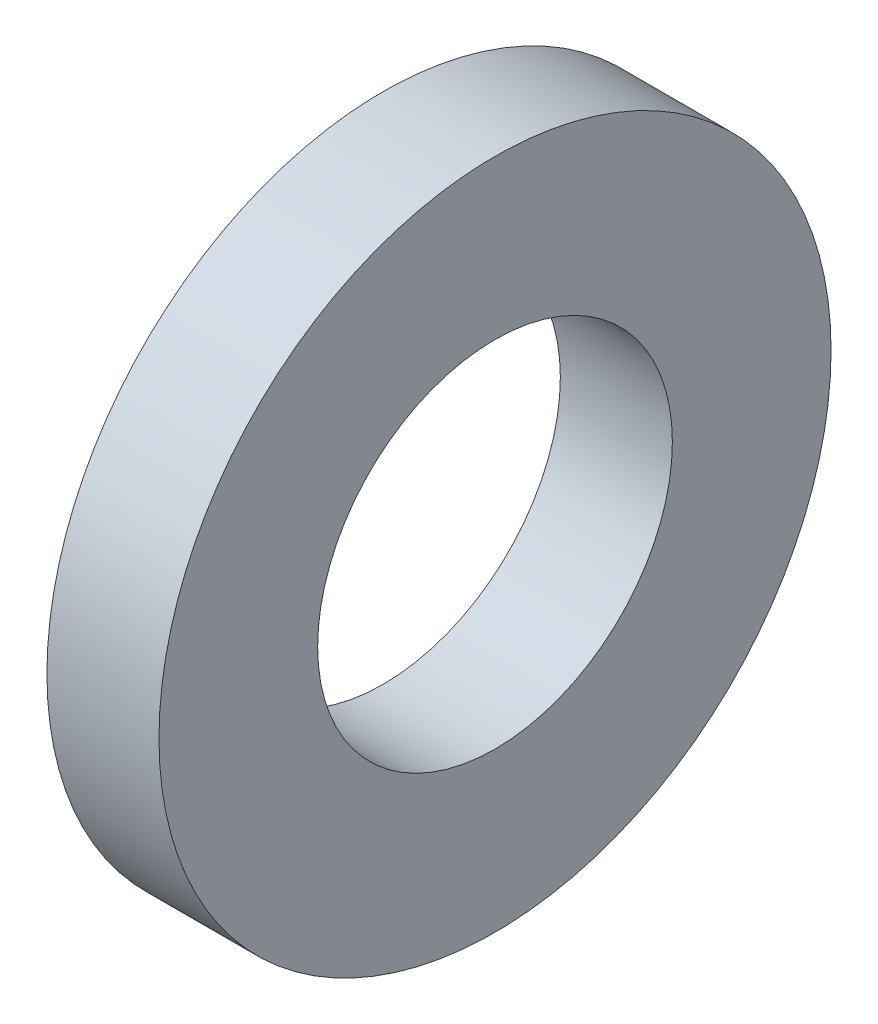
from build123d import *

# Parameters (mm, degrees)
SKETCH1_W                         = 76.2
SKETCH1_H                         = 107.95
SKETCH2_R                         = 12.7
F_25_4_MM_HOLE_CUT_EXTRUDE1_DEPTH = 30
F_25_4MM_HOLES_CIRPATTERN1_COUNT  = 8


with BuildPart() as part:
    # Sketch1 → Revolve1 (revolve)
    with BuildSketch(Plane.XY, mode=Mode.PRIVATE) as revolve1_sk:
        with Locations((38.1, 174.625)):
            Rectangle(SKETCH1_W, SKETCH1_H)
    revolve(revolve1_sk.sketch.rotate(Axis((0, 0, 0), (1, 0, 0)), 90), axis=Axis((0, 0, 0), (1, 0, 0)))

    # Sketch2 → 25.4 mm hole Cut-Extrude1 (cut)
    with BuildSketch(Plane.ZY):
        with Locations((60.750994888, 146.665875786)):
            Circle(SKETCH2_R)
    f_25_4_mm_hole_cut_extrude1 = extrude(amount=-F_25_4_MM_HOLE_CUT_EXTRUDE1_DEPTH, mode=Mode.SUBTRACT)

    # 25.4mm holes CirPattern1: 25.4 mm hole Cut-Extrude1 ×8 about axis
    f_25_4mm_holes_cirpattern1_axis = Axis((0, 0, 0), (1, 0, 0))
    for i in range(1, F_25_4MM_HOLES_CIRPATTERN1_COUNT):
        add(f_25_4_mm_hole_cut_extrude1.rotate(f_25_4mm_holes_cirpattern1_axis, i * 360 / F_25_4MM_HOLES_CIRPATTERN1_COUNT), mode=Mode.SUBTRACT)


solid = part.part
